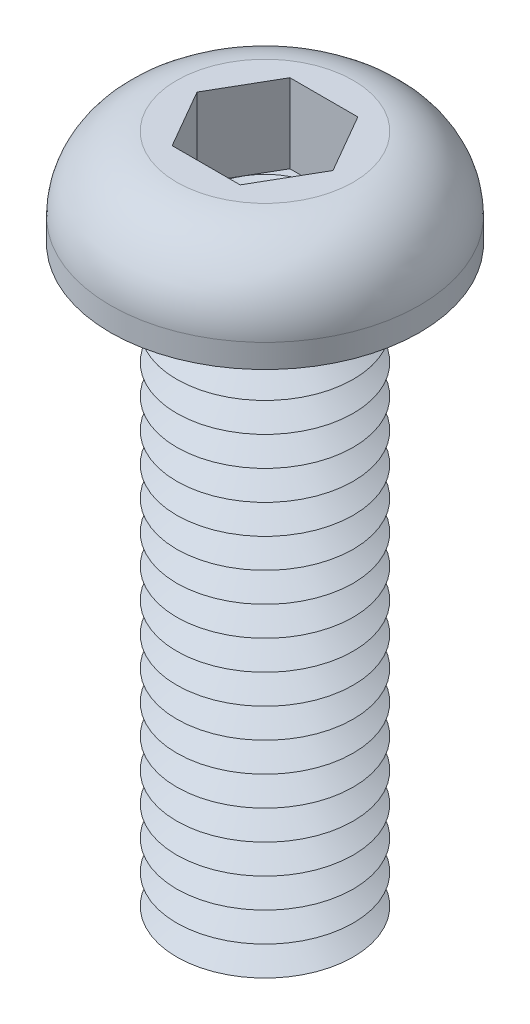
ISO-10303-21;
HEADER;
FILE_DESCRIPTION(('STEP AP214'),'2;1');
FILE_NAME('part.step','',(''),(''),'','','');
FILE_SCHEMA(('AUTOMOTIVE_DESIGN { 1 0 10303 214 1 1 1 1 }'));
ENDSEC;
DATA;
#1=APPLICATION_CONTEXT('core data for automotive mechanical design processes');
#2=APPLICATION_PROTOCOL_DEFINITION('international standard','automotive_design',2000,#1);
#3=PRODUCT_CONTEXT('',#1,'mechanical');
#4=PRODUCT('Part','Part','',(#3));
#5=PRODUCT_RELATED_PRODUCT_CATEGORY('part','',(#4));
#6=PRODUCT_DEFINITION_FORMATION('','',#4);
#7=PRODUCT_DEFINITION_CONTEXT('part definition',#1,'design');
#8=PRODUCT_DEFINITION('design','',#6,#7);
#9=PRODUCT_DEFINITION_SHAPE('','',#8);
#10=(LENGTH_UNIT() NAMED_UNIT(*) SI_UNIT(.MILLI.,.METRE.));
#11=(NAMED_UNIT(*) PLANE_ANGLE_UNIT() SI_UNIT($,.RADIAN.));
#12=(NAMED_UNIT(*) SI_UNIT($,.STERADIAN.) SOLID_ANGLE_UNIT());
#13=UNCERTAINTY_MEASURE_WITH_UNIT(LENGTH_MEASURE(1.E-05),#10,'distance_accuracy_value','');
#14=(GEOMETRIC_REPRESENTATION_CONTEXT(3) GLOBAL_UNCERTAINTY_ASSIGNED_CONTEXT((#13)) GLOBAL_UNIT_ASSIGNED_CONTEXT((#10,
#11,#12)) REPRESENTATION_CONTEXT('',''));
#15=CARTESIAN_POINT('',(0.,0.,0.));
#16=DIRECTION('',(0.,0.,1.));
#17=DIRECTION('',(1.,0.,0.));
#18=AXIS2_PLACEMENT_3D('',#15,#16,#17);
#19=CARTESIAN_POINT('',(0.,0.,0.));
#20=DIRECTION('',(0.,-1.,0.));
#21=DIRECTION('',(0.,0.,-1.));
#22=AXIS2_PLACEMENT_3D('',#19,#20,#21);
#23=TOROIDAL_SURFACE('',#22,3.5,0.5);
#24=CARTESIAN_POINT('',(0.,0.,-4.));
#25=VERTEX_POINT('',#24);
#26=VERTEX_LOOP('',#25);
#27=FACE_BOUND('',#26,.T.);
#28=ADVANCED_FACE('P0_F12',(#27),#23,.T.);
#29=CLOSED_SHELL('',(#28));
#30=MANIFOLD_SOLID_BREP('P0_B1',#29);
#31=CARTESIAN_POINT('',(1.15470053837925,0.62,-2.));
#32=DIRECTION('',(0.,1.,0.));
#33=DIRECTION('',(0.,0.,1.));
#34=AXIS2_PLACEMENT_3D('',#31,#32,#33);
#35=PLANE('',#34);
#36=CARTESIAN_POINT('',(0.,0.62,0.));
#37=DIRECTION('',(0.,1.,0.));
#38=DIRECTION('',(0.,0.,1.));
#39=AXIS2_PLACEMENT_3D('',#36,#37,#38);
#40=CIRCLE('',#39,2.);
#41=CARTESIAN_POINT('',(0.,0.62,2.));
#42=VERTEX_POINT('',#41);
#43=CARTESIAN_POINT('',(1.73205080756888,0.62,1.));
#44=VERTEX_POINT('',#43);
#45=EDGE_CURVE('P1_E93',#42,#44,#40,.T.);
#46=ORIENTED_EDGE('',*,*,#45,.F.);
#47=DIRECTION('',(1.,0.,0.));
#48=VECTOR('',#47,1.);
#49=CARTESIAN_POINT('',(-1.15470053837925,0.62,2.));
#50=LINE('',#49,#48);
#51=CARTESIAN_POINT('',(1.15470053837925,0.62,2.));
#52=VERTEX_POINT('',#51);
#53=EDGE_CURVE('P1_E116',#42,#52,#50,.T.);
#54=ORIENTED_EDGE('',*,*,#53,.T.);
#55=DIRECTION('',(0.5,0.,-0.866025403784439));
#56=VECTOR('',#55,1.);
#57=CARTESIAN_POINT('',(1.15470053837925,0.62,2.));
#58=LINE('',#57,#56);
#59=EDGE_CURVE('P1_E112',#52,#44,#58,.T.);
#60=ORIENTED_EDGE('',*,*,#59,.T.);
#61=EDGE_LOOP('',(#46,#54,#60));
#62=FACE_BOUND('',#61,.T.);
#63=ADVANCED_FACE('P1_F15',(#62),#35,.T.);
#64=CARTESIAN_POINT('',(0.,0.62,0.));
#65=DIRECTION('',(0.,1.,0.));
#66=DIRECTION('',(0.,0.,1.));
#67=AXIS2_PLACEMENT_3D('',#64,#65,#66);
#68=CIRCLE('',#67,2.);
#69=CARTESIAN_POINT('',(1.73205080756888,0.62,-1.));
#70=VERTEX_POINT('',#69);
#71=EDGE_CURVE('P1_E10',#44,#70,#68,.T.);
#72=ORIENTED_EDGE('',*,*,#71,.F.);
#73=CARTESIAN_POINT('',(2.3094010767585,0.62,0.));
#74=VERTEX_POINT('',#73);
#75=EDGE_CURVE('P1_E104',#44,#74,#58,.T.);
#76=ORIENTED_EDGE('',*,*,#75,.T.);
#77=DIRECTION('',(-0.5,0.,-0.866025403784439));
#78=VECTOR('',#77,1.);
#79=CARTESIAN_POINT('',(2.3094010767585,0.62,0.));
#80=LINE('',#79,#78);
#81=EDGE_CURVE('P1_E107',#74,#70,#80,.T.);
#82=ORIENTED_EDGE('',*,*,#81,.T.);
#83=EDGE_LOOP('',(#72,#76,#82));
#84=FACE_BOUND('',#83,.T.);
#85=ADVANCED_FACE('P1_F103',(#84),#35,.T.);
#86=CARTESIAN_POINT('',(0.,0.62,-2.));
#87=VERTEX_POINT('',#86);
#88=EDGE_CURVE('P1_E24',#70,#87,#68,.T.);
#89=ORIENTED_EDGE('',*,*,#88,.F.);
#90=CARTESIAN_POINT('',(1.15470053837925,0.62,-2.));
#91=VERTEX_POINT('',#90);
#92=EDGE_CURVE('P1_E139',#70,#91,#80,.T.);
#93=ORIENTED_EDGE('',*,*,#92,.T.);
#94=DIRECTION('',(-1.,0.,0.));
#95=VECTOR('',#94,1.);
#96=CARTESIAN_POINT('',(1.15470053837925,0.62,-2.));
#97=LINE('',#96,#95);
#98=EDGE_CURVE('P1_E336',#91,#87,#97,.T.);
#99=ORIENTED_EDGE('',*,*,#98,.T.);
#100=EDGE_LOOP('',(#89,#93,#99));
#101=FACE_BOUND('',#100,.T.);
#102=ADVANCED_FACE('P1_F301',(#101),#35,.T.);
#103=CARTESIAN_POINT('',(-1.73205080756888,0.62,-1.));
#104=VERTEX_POINT('',#103);
#105=EDGE_CURVE('P1_E331',#87,#104,#68,.T.);
#106=ORIENTED_EDGE('',*,*,#105,.F.);
#107=CARTESIAN_POINT('',(-1.15470053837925,0.62,-2.));
#108=VERTEX_POINT('',#107);
#109=EDGE_CURVE('P1_E340',#87,#108,#97,.T.);
#110=ORIENTED_EDGE('',*,*,#109,.T.);
#111=DIRECTION('',(-0.5,0.,0.866025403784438));
#112=VECTOR('',#111,1.);
#113=CARTESIAN_POINT('',(-1.15470053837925,0.62,-2.));
#114=LINE('',#113,#112);
#115=EDGE_CURVE('P1_E335',#108,#104,#114,.T.);
#116=ORIENTED_EDGE('',*,*,#115,.T.);
#117=EDGE_LOOP('',(#106,#110,#116));
#118=FACE_BOUND('',#117,.T.);
#119=ADVANCED_FACE('P1_F315',(#118),#35,.T.);
#120=CARTESIAN_POINT('',(-1.73205080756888,0.62,1.));
#121=VERTEX_POINT('',#120);
#122=EDGE_CURVE('P1_E31',#104,#121,#68,.T.);
#123=ORIENTED_EDGE('',*,*,#122,.F.);
#124=CARTESIAN_POINT('',(-2.3094010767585,0.62,0.));
#125=VERTEX_POINT('',#124);
#126=EDGE_CURVE('P1_E327',#104,#125,#114,.T.);
#127=ORIENTED_EDGE('',*,*,#126,.T.);
#128=DIRECTION('',(0.5,0.,0.866025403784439));
#129=VECTOR('',#128,1.);
#130=CARTESIAN_POINT('',(-2.3094010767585,0.62,0.));
#131=LINE('',#130,#129);
#132=EDGE_CURVE('P1_E330',#125,#121,#131,.T.);
#133=ORIENTED_EDGE('',*,*,#132,.T.);
#134=EDGE_LOOP('',(#123,#127,#133));
#135=FACE_BOUND('',#134,.T.);
#136=ADVANCED_FACE('P1_F306',(#135),#35,.T.);
#137=CARTESIAN_POINT('',(0.,-19.,0.));
#138=DIRECTION('',(0.,1.,0.));
#139=DIRECTION('',(0.,0.,1.));
#140=AXIS2_PLACEMENT_3D('',#137,#138,#139);
#141=CONICAL_SURFACE('',#140,2.13397459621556,1.0471975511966);
#142=CARTESIAN_POINT('',(0.,-18.5,0.));
#143=DIRECTION('',(0.,-1.,0.));
#144=DIRECTION('',(0.,0.,-1.));
#145=AXIS2_PLACEMENT_3D('',#142,#143,#144);
#146=CIRCLE('',#145,3.);
#147=CARTESIAN_POINT('',(0.,-18.5,-3.));
#148=VERTEX_POINT('',#147);
#149=EDGE_CURVE('P1_E263',#148,#148,#146,.T.);
#150=ORIENTED_EDGE('',*,*,#149,.T.);
#151=EDGE_LOOP('',(#150));
#152=FACE_BOUND('',#151,.T.);
#153=CARTESIAN_POINT('',(0.,-19.,0.));
#154=DIRECTION('',(0.,-1.,0.));
#155=DIRECTION('',(0.,0.,-1.));
#156=AXIS2_PLACEMENT_3D('',#153,#154,#155);
#157=CIRCLE('',#156,2.13397459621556);
#158=CARTESIAN_POINT('',(0.,-19.,-2.13397459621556));
#159=VERTEX_POINT('',#158);
#160=EDGE_CURVE('P1_E266',#159,#159,#157,.T.);
#161=ORIENTED_EDGE('',*,*,#160,.F.);
#162=EDGE_LOOP('',(#161));
#163=FACE_BOUND('',#162,.T.);
#164=ADVANCED_FACE('P1_F314',(#152,#163),#141,.T.);
#165=CARTESIAN_POINT('',(0.,-19.5,0.));
#166=DIRECTION('',(0.,-1.,0.));
#167=DIRECTION('',(0.,0.,-1.));
#168=AXIS2_PLACEMENT_3D('',#165,#166,#167);
#169=CONICAL_SURFACE('',#168,3.,1.0471975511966);
#170=ORIENTED_EDGE('',*,*,#160,.T.);
#171=EDGE_LOOP('',(#170));
#172=FACE_BOUND('',#171,.T.);
#173=CARTESIAN_POINT('',(0.,-19.5,0.));
#174=DIRECTION('',(0.,-1.,0.));
#175=DIRECTION('',(0.,0.,-1.));
#176=AXIS2_PLACEMENT_3D('',#173,#174,#175);
#177=CIRCLE('',#176,3.);
#178=CARTESIAN_POINT('',(0.,-19.5,-3.));
#179=VERTEX_POINT('',#178);
#180=EDGE_CURVE('P1_E269',#179,#179,#177,.T.);
#181=ORIENTED_EDGE('',*,*,#180,.F.);
#182=EDGE_LOOP('',(#181));
#183=FACE_BOUND('',#182,.T.);
#184=ADVANCED_FACE('P1_F321',(#172,#183),#169,.T.);
#185=CARTESIAN_POINT('',(0.,-20.,0.));
#186=DIRECTION('',(0.,1.,0.));
#187=DIRECTION('',(0.,0.,1.));
#188=AXIS2_PLACEMENT_3D('',#185,#186,#187);
#189=PLANE('',#188);
#190=CARTESIAN_POINT('',(0.,-20.,0.));
#191=DIRECTION('',(0.,-1.,0.));
#192=DIRECTION('',(0.,0.,-1.));
#193=AXIS2_PLACEMENT_3D('',#190,#191,#192);
#194=CIRCLE('',#193,2.13397459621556);
#195=CARTESIAN_POINT('',(0.,-20.,-2.13397459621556));
#196=VERTEX_POINT('',#195);
#197=EDGE_CURVE('P1_E272',#196,#196,#194,.T.);
#198=ORIENTED_EDGE('',*,*,#197,.T.);
#199=EDGE_LOOP('',(#198));
#200=FACE_BOUND('',#199,.T.);
#201=ADVANCED_FACE('P1_F399',(#200),#189,.F.);
#202=CARTESIAN_POINT('',(0.,-20.,0.));
#203=DIRECTION('',(0.,1.,0.));
#204=DIRECTION('',(0.,0.,1.));
#205=AXIS2_PLACEMENT_3D('',#202,#203,#204);
#206=CONICAL_SURFACE('',#205,2.13397459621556,1.0471975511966);
#207=ORIENTED_EDGE('',*,*,#180,.T.);
#208=EDGE_LOOP('',(#207));
#209=FACE_BOUND('',#208,.T.);
#210=ORIENTED_EDGE('',*,*,#197,.F.);
#211=EDGE_LOOP('',(#210));
#212=FACE_BOUND('',#211,.T.);
#213=ADVANCED_FACE('P1_F410',(#209,#212),#206,.T.);
#214=CARTESIAN_POINT('',(0.,-18.,0.));
#215=DIRECTION('',(0.,1.,0.));
#216=DIRECTION('',(0.,0.,1.));
#217=AXIS2_PLACEMENT_3D('',#214,#215,#216);
#218=CONICAL_SURFACE('',#217,2.13397459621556,1.0471975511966);
#219=CARTESIAN_POINT('',(0.,-17.5,0.));
#220=DIRECTION('',(0.,-1.,0.));
#221=DIRECTION('',(0.,0.,-1.));
#222=AXIS2_PLACEMENT_3D('',#219,#220,#221);
#223=CIRCLE('',#222,3.);
#224=CARTESIAN_POINT('',(0.,-17.5,-3.));
#225=VERTEX_POINT('',#224);
#226=EDGE_CURVE('P1_E257',#225,#225,#223,.T.);
#227=ORIENTED_EDGE('',*,*,#226,.T.);
#228=EDGE_LOOP('',(#227));
#229=FACE_BOUND('',#228,.T.);
#230=CARTESIAN_POINT('',(0.,-18.,0.));
#231=DIRECTION('',(0.,-1.,0.));
#232=DIRECTION('',(0.,0.,-1.));
#233=AXIS2_PLACEMENT_3D('',#230,#231,#232);
#234=CIRCLE('',#233,2.13397459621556);
#235=CARTESIAN_POINT('',(0.,-18.,-2.13397459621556));
#236=VERTEX_POINT('',#235);
#237=EDGE_CURVE('P1_E260',#236,#236,#234,.T.);
#238=ORIENTED_EDGE('',*,*,#237,.F.);
#239=EDGE_LOOP('',(#238));
#240=FACE_BOUND('',#239,.T.);
#241=ADVANCED_FACE('P1_F419',(#229,#240),#218,.T.);
#242=CARTESIAN_POINT('',(0.,-18.5,0.));
#243=DIRECTION('',(0.,-1.,0.));
#244=DIRECTION('',(0.,0.,-1.));
#245=AXIS2_PLACEMENT_3D('',#242,#243,#244);
#246=CONICAL_SURFACE('',#245,3.,1.0471975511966);
#247=ORIENTED_EDGE('',*,*,#237,.T.);
#248=EDGE_LOOP('',(#247));
#249=FACE_BOUND('',#248,.T.);
#250=ORIENTED_EDGE('',*,*,#149,.F.);
#251=EDGE_LOOP('',(#250));
#252=FACE_BOUND('',#251,.T.);
#253=ADVANCED_FACE('P1_F428',(#249,#252),#246,.T.);
#254=CARTESIAN_POINT('',(0.,-17.,0.));
#255=DIRECTION('',(0.,1.,0.));
#256=DIRECTION('',(0.,0.,1.));
#257=AXIS2_PLACEMENT_3D('',#254,#255,#256);
#258=CONICAL_SURFACE('',#257,2.13397459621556,1.0471975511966);
#259=CARTESIAN_POINT('',(0.,-16.5,0.));
#260=DIRECTION('',(0.,-1.,0.));
#261=DIRECTION('',(0.,0.,-1.));
#262=AXIS2_PLACEMENT_3D('',#259,#260,#261);
#263=CIRCLE('',#262,3.);
#264=CARTESIAN_POINT('',(0.,-16.5,-3.));
#265=VERTEX_POINT('',#264);
#266=EDGE_CURVE('P1_E251',#265,#265,#263,.T.);
#267=ORIENTED_EDGE('',*,*,#266,.T.);
#268=EDGE_LOOP('',(#267));
#269=FACE_BOUND('',#268,.T.);
#270=CARTESIAN_POINT('',(0.,-17.,0.));
#271=DIRECTION('',(0.,-1.,0.));
#272=DIRECTION('',(0.,0.,-1.));
#273=AXIS2_PLACEMENT_3D('',#270,#271,#272);
#274=CIRCLE('',#273,2.13397459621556);
#275=CARTESIAN_POINT('',(0.,-17.,-2.13397459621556));
#276=VERTEX_POINT('',#275);
#277=EDGE_CURVE('P1_E254',#276,#276,#274,.T.);
#278=ORIENTED_EDGE('',*,*,#277,.F.);
#279=EDGE_LOOP('',(#278));
#280=FACE_BOUND('',#279,.T.);
#281=ADVANCED_FACE('P1_F438',(#269,#280),#258,.T.);
#282=CARTESIAN_POINT('',(0.,-17.5,0.));
#283=DIRECTION('',(0.,-1.,0.));
#284=DIRECTION('',(0.,0.,-1.));
#285=AXIS2_PLACEMENT_3D('',#282,#283,#284);
#286=CONICAL_SURFACE('',#285,3.,1.0471975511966);
#287=ORIENTED_EDGE('',*,*,#277,.T.);
#288=EDGE_LOOP('',(#287));
#289=FACE_BOUND('',#288,.T.);
#290=ORIENTED_EDGE('',*,*,#226,.F.);
#291=EDGE_LOOP('',(#290));
#292=FACE_BOUND('',#291,.T.);
#293=ADVANCED_FACE('P1_F448',(#289,#292),#286,.T.);
#294=CARTESIAN_POINT('',(0.,-16.,0.));
#295=DIRECTION('',(0.,1.,0.));
#296=DIRECTION('',(0.,0.,1.));
#297=AXIS2_PLACEMENT_3D('',#294,#295,#296);
#298=CONICAL_SURFACE('',#297,2.13397459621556,1.0471975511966);
#299=CARTESIAN_POINT('',(0.,-15.5,0.));
#300=DIRECTION('',(0.,-1.,0.));
#301=DIRECTION('',(0.,0.,-1.));
#302=AXIS2_PLACEMENT_3D('',#299,#300,#301);
#303=CIRCLE('',#302,3.);
#304=CARTESIAN_POINT('',(0.,-15.5,-3.));
#305=VERTEX_POINT('',#304);
#306=EDGE_CURVE('P1_E245',#305,#305,#303,.T.);
#307=ORIENTED_EDGE('',*,*,#306,.T.);
#308=EDGE_LOOP('',(#307));
#309=FACE_BOUND('',#308,.T.);
#310=CARTESIAN_POINT('',(0.,-16.,0.));
#311=DIRECTION('',(0.,-1.,0.));
#312=DIRECTION('',(0.,0.,-1.));
#313=AXIS2_PLACEMENT_3D('',#310,#311,#312);
#314=CIRCLE('',#313,2.13397459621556);
#315=CARTESIAN_POINT('',(0.,-16.,-2.13397459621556));
#316=VERTEX_POINT('',#315);
#317=EDGE_CURVE('P1_E248',#316,#316,#314,.T.);
#318=ORIENTED_EDGE('',*,*,#317,.F.);
#319=EDGE_LOOP('',(#318));
#320=FACE_BOUND('',#319,.T.);
#321=ADVANCED_FACE('P1_F458',(#309,#320),#298,.T.);
#322=CARTESIAN_POINT('',(0.,-16.5,0.));
#323=DIRECTION('',(0.,-1.,0.));
#324=DIRECTION('',(0.,0.,-1.));
#325=AXIS2_PLACEMENT_3D('',#322,#323,#324);
#326=CONICAL_SURFACE('',#325,3.,1.0471975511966);
#327=ORIENTED_EDGE('',*,*,#317,.T.);
#328=EDGE_LOOP('',(#327));
#329=FACE_BOUND('',#328,.T.);
#330=ORIENTED_EDGE('',*,*,#266,.F.);
#331=EDGE_LOOP('',(#330));
#332=FACE_BOUND('',#331,.T.);
#333=ADVANCED_FACE('P1_F468',(#329,#332),#326,.T.);
#334=CARTESIAN_POINT('',(0.,-15.,0.));
#335=DIRECTION('',(0.,1.,0.));
#336=DIRECTION('',(0.,0.,1.));
#337=AXIS2_PLACEMENT_3D('',#334,#335,#336);
#338=CONICAL_SURFACE('',#337,2.13397459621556,1.0471975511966);
#339=CARTESIAN_POINT('',(0.,-14.5,0.));
#340=DIRECTION('',(0.,-1.,0.));
#341=DIRECTION('',(0.,0.,-1.));
#342=AXIS2_PLACEMENT_3D('',#339,#340,#341);
#343=CIRCLE('',#342,3.);
#344=CARTESIAN_POINT('',(0.,-14.5,-3.));
#345=VERTEX_POINT('',#344);
#346=EDGE_CURVE('P1_E239',#345,#345,#343,.T.);
#347=ORIENTED_EDGE('',*,*,#346,.T.);
#348=EDGE_LOOP('',(#347));
#349=FACE_BOUND('',#348,.T.);
#350=CARTESIAN_POINT('',(0.,-15.,0.));
#351=DIRECTION('',(0.,-1.,0.));
#352=DIRECTION('',(0.,0.,-1.));
#353=AXIS2_PLACEMENT_3D('',#350,#351,#352);
#354=CIRCLE('',#353,2.13397459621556);
#355=CARTESIAN_POINT('',(0.,-15.,-2.13397459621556));
#356=VERTEX_POINT('',#355);
#357=EDGE_CURVE('P1_E242',#356,#356,#354,.T.);
#358=ORIENTED_EDGE('',*,*,#357,.F.);
#359=EDGE_LOOP('',(#358));
#360=FACE_BOUND('',#359,.T.);
#361=ADVANCED_FACE('P1_F478',(#349,#360),#338,.T.);
#362=CARTESIAN_POINT('',(0.,-15.5,0.));
#363=DIRECTION('',(0.,-1.,0.));
#364=DIRECTION('',(0.,0.,-1.));
#365=AXIS2_PLACEMENT_3D('',#362,#363,#364);
#366=CONICAL_SURFACE('',#365,3.,1.0471975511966);
#367=ORIENTED_EDGE('',*,*,#357,.T.);
#368=EDGE_LOOP('',(#367));
#369=FACE_BOUND('',#368,.T.);
#370=ORIENTED_EDGE('',*,*,#306,.F.);
#371=EDGE_LOOP('',(#370));
#372=FACE_BOUND('',#371,.T.);
#373=ADVANCED_FACE('P1_F488',(#369,#372),#366,.T.);
#374=CARTESIAN_POINT('',(0.,-14.,0.));
#375=DIRECTION('',(0.,1.,0.));
#376=DIRECTION('',(0.,0.,1.));
#377=AXIS2_PLACEMENT_3D('',#374,#375,#376);
#378=CONICAL_SURFACE('',#377,2.13397459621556,1.0471975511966);
#379=CARTESIAN_POINT('',(0.,-13.5,0.));
#380=DIRECTION('',(0.,-1.,0.));
#381=DIRECTION('',(0.,0.,-1.));
#382=AXIS2_PLACEMENT_3D('',#379,#380,#381);
#383=CIRCLE('',#382,3.);
#384=CARTESIAN_POINT('',(0.,-13.5,-3.));
#385=VERTEX_POINT('',#384);
#386=EDGE_CURVE('P1_E233',#385,#385,#383,.T.);
#387=ORIENTED_EDGE('',*,*,#386,.T.);
#388=EDGE_LOOP('',(#387));
#389=FACE_BOUND('',#388,.T.);
#390=CARTESIAN_POINT('',(0.,-14.,0.));
#391=DIRECTION('',(0.,-1.,0.));
#392=DIRECTION('',(0.,0.,-1.));
#393=AXIS2_PLACEMENT_3D('',#390,#391,#392);
#394=CIRCLE('',#393,2.13397459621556);
#395=CARTESIAN_POINT('',(0.,-14.,-2.13397459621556));
#396=VERTEX_POINT('',#395);
#397=EDGE_CURVE('P1_E236',#396,#396,#394,.T.);
#398=ORIENTED_EDGE('',*,*,#397,.F.);
#399=EDGE_LOOP('',(#398));
#400=FACE_BOUND('',#399,.T.);
#401=ADVANCED_FACE('P1_F498',(#389,#400),#378,.T.);
#402=CARTESIAN_POINT('',(0.,-14.5,0.));
#403=DIRECTION('',(0.,-1.,0.));
#404=DIRECTION('',(0.,0.,-1.));
#405=AXIS2_PLACEMENT_3D('',#402,#403,#404);
#406=CONICAL_SURFACE('',#405,3.,1.0471975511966);
#407=ORIENTED_EDGE('',*,*,#397,.T.);
#408=EDGE_LOOP('',(#407));
#409=FACE_BOUND('',#408,.T.);
#410=ORIENTED_EDGE('',*,*,#346,.F.);
#411=EDGE_LOOP('',(#410));
#412=FACE_BOUND('',#411,.T.);
#413=ADVANCED_FACE('P1_F508',(#409,#412),#406,.T.);
#414=CARTESIAN_POINT('',(0.,-13.,0.));
#415=DIRECTION('',(0.,1.,0.));
#416=DIRECTION('',(0.,0.,1.));
#417=AXIS2_PLACEMENT_3D('',#414,#415,#416);
#418=CONICAL_SURFACE('',#417,2.13397459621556,1.0471975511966);
#419=CARTESIAN_POINT('',(0.,-12.5,0.));
#420=DIRECTION('',(0.,-1.,0.));
#421=DIRECTION('',(0.,0.,-1.));
#422=AXIS2_PLACEMENT_3D('',#419,#420,#421);
#423=CIRCLE('',#422,3.);
#424=CARTESIAN_POINT('',(0.,-12.5,-3.));
#425=VERTEX_POINT('',#424);
#426=EDGE_CURVE('P1_E227',#425,#425,#423,.T.);
#427=ORIENTED_EDGE('',*,*,#426,.T.);
#428=EDGE_LOOP('',(#427));
#429=FACE_BOUND('',#428,.T.);
#430=CARTESIAN_POINT('',(0.,-13.,0.));
#431=DIRECTION('',(0.,-1.,0.));
#432=DIRECTION('',(0.,0.,-1.));
#433=AXIS2_PLACEMENT_3D('',#430,#431,#432);
#434=CIRCLE('',#433,2.13397459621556);
#435=CARTESIAN_POINT('',(0.,-13.,-2.13397459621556));
#436=VERTEX_POINT('',#435);
#437=EDGE_CURVE('P1_E230',#436,#436,#434,.T.);
#438=ORIENTED_EDGE('',*,*,#437,.F.);
#439=EDGE_LOOP('',(#438));
#440=FACE_BOUND('',#439,.T.);
#441=ADVANCED_FACE('P1_F518',(#429,#440),#418,.T.);
#442=CARTESIAN_POINT('',(0.,-13.5,0.));
#443=DIRECTION('',(0.,-1.,0.));
#444=DIRECTION('',(0.,0.,-1.));
#445=AXIS2_PLACEMENT_3D('',#442,#443,#444);
#446=CONICAL_SURFACE('',#445,3.,1.0471975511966);
#447=ORIENTED_EDGE('',*,*,#437,.T.);
#448=EDGE_LOOP('',(#447));
#449=FACE_BOUND('',#448,.T.);
#450=ORIENTED_EDGE('',*,*,#386,.F.);
#451=EDGE_LOOP('',(#450));
#452=FACE_BOUND('',#451,.T.);
#453=ADVANCED_FACE('P1_F528',(#449,#452),#446,.T.);
#454=CARTESIAN_POINT('',(0.,-12.,0.));
#455=DIRECTION('',(0.,1.,0.));
#456=DIRECTION('',(0.,0.,1.));
#457=AXIS2_PLACEMENT_3D('',#454,#455,#456);
#458=CONICAL_SURFACE('',#457,2.13397459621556,1.0471975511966);
#459=CARTESIAN_POINT('',(0.,-11.5,0.));
#460=DIRECTION('',(0.,-1.,0.));
#461=DIRECTION('',(0.,0.,-1.));
#462=AXIS2_PLACEMENT_3D('',#459,#460,#461);
#463=CIRCLE('',#462,3.);
#464=CARTESIAN_POINT('',(0.,-11.5,-3.));
#465=VERTEX_POINT('',#464);
#466=EDGE_CURVE('P1_E221',#465,#465,#463,.T.);
#467=ORIENTED_EDGE('',*,*,#466,.T.);
#468=EDGE_LOOP('',(#467));
#469=FACE_BOUND('',#468,.T.);
#470=CARTESIAN_POINT('',(0.,-12.,0.));
#471=DIRECTION('',(0.,-1.,0.));
#472=DIRECTION('',(0.,0.,-1.));
#473=AXIS2_PLACEMENT_3D('',#470,#471,#472);
#474=CIRCLE('',#473,2.13397459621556);
#475=CARTESIAN_POINT('',(0.,-12.,-2.13397459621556));
#476=VERTEX_POINT('',#475);
#477=EDGE_CURVE('P1_E224',#476,#476,#474,.T.);
#478=ORIENTED_EDGE('',*,*,#477,.F.);
#479=EDGE_LOOP('',(#478));
#480=FACE_BOUND('',#479,.T.);
#481=ADVANCED_FACE('P1_F538',(#469,#480),#458,.T.);
#482=CARTESIAN_POINT('',(0.,-12.5,0.));
#483=DIRECTION('',(0.,-1.,0.));
#484=DIRECTION('',(0.,0.,-1.));
#485=AXIS2_PLACEMENT_3D('',#482,#483,#484);
#486=CONICAL_SURFACE('',#485,3.,1.0471975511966);
#487=ORIENTED_EDGE('',*,*,#477,.T.);
#488=EDGE_LOOP('',(#487));
#489=FACE_BOUND('',#488,.T.);
#490=ORIENTED_EDGE('',*,*,#426,.F.);
#491=EDGE_LOOP('',(#490));
#492=FACE_BOUND('',#491,.T.);
#493=ADVANCED_FACE('P1_F548',(#489,#492),#486,.T.);
#494=CARTESIAN_POINT('',(0.,-11.,0.));
#495=DIRECTION('',(0.,1.,0.));
#496=DIRECTION('',(0.,0.,1.));
#497=AXIS2_PLACEMENT_3D('',#494,#495,#496);
#498=CONICAL_SURFACE('',#497,2.13397459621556,1.0471975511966);
#499=CARTESIAN_POINT('',(0.,-10.5,0.));
#500=DIRECTION('',(0.,-1.,0.));
#501=DIRECTION('',(0.,0.,-1.));
#502=AXIS2_PLACEMENT_3D('',#499,#500,#501);
#503=CIRCLE('',#502,3.);
#504=CARTESIAN_POINT('',(0.,-10.5,-3.));
#505=VERTEX_POINT('',#504);
#506=EDGE_CURVE('P1_E215',#505,#505,#503,.T.);
#507=ORIENTED_EDGE('',*,*,#506,.T.);
#508=EDGE_LOOP('',(#507));
#509=FACE_BOUND('',#508,.T.);
#510=CARTESIAN_POINT('',(0.,-11.,0.));
#511=DIRECTION('',(0.,-1.,0.));
#512=DIRECTION('',(0.,0.,-1.));
#513=AXIS2_PLACEMENT_3D('',#510,#511,#512);
#514=CIRCLE('',#513,2.13397459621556);
#515=CARTESIAN_POINT('',(0.,-11.,-2.13397459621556));
#516=VERTEX_POINT('',#515);
#517=EDGE_CURVE('P1_E218',#516,#516,#514,.T.);
#518=ORIENTED_EDGE('',*,*,#517,.F.);
#519=EDGE_LOOP('',(#518));
#520=FACE_BOUND('',#519,.T.);
#521=ADVANCED_FACE('P1_F558',(#509,#520),#498,.T.);
#522=CARTESIAN_POINT('',(0.,-11.5,0.));
#523=DIRECTION('',(0.,-1.,0.));
#524=DIRECTION('',(0.,0.,-1.));
#525=AXIS2_PLACEMENT_3D('',#522,#523,#524);
#526=CONICAL_SURFACE('',#525,3.,1.0471975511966);
#527=ORIENTED_EDGE('',*,*,#517,.T.);
#528=EDGE_LOOP('',(#527));
#529=FACE_BOUND('',#528,.T.);
#530=ORIENTED_EDGE('',*,*,#466,.F.);
#531=EDGE_LOOP('',(#530));
#532=FACE_BOUND('',#531,.T.);
#533=ADVANCED_FACE('P1_F568',(#529,#532),#526,.T.);
#534=CARTESIAN_POINT('',(0.,-10.,0.));
#535=DIRECTION('',(0.,1.,0.));
#536=DIRECTION('',(0.,0.,1.));
#537=AXIS2_PLACEMENT_3D('',#534,#535,#536);
#538=CONICAL_SURFACE('',#537,2.13397459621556,1.0471975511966);
#539=CARTESIAN_POINT('',(0.,-9.5,0.));
#540=DIRECTION('',(0.,-1.,0.));
#541=DIRECTION('',(0.,0.,-1.));
#542=AXIS2_PLACEMENT_3D('',#539,#540,#541);
#543=CIRCLE('',#542,3.);
#544=CARTESIAN_POINT('',(0.,-9.5,-3.));
#545=VERTEX_POINT('',#544);
#546=EDGE_CURVE('P1_E209',#545,#545,#543,.T.);
#547=ORIENTED_EDGE('',*,*,#546,.T.);
#548=EDGE_LOOP('',(#547));
#549=FACE_BOUND('',#548,.T.);
#550=CARTESIAN_POINT('',(0.,-10.,0.));
#551=DIRECTION('',(0.,-1.,0.));
#552=DIRECTION('',(0.,0.,-1.));
#553=AXIS2_PLACEMENT_3D('',#550,#551,#552);
#554=CIRCLE('',#553,2.13397459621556);
#555=CARTESIAN_POINT('',(0.,-10.,-2.13397459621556));
#556=VERTEX_POINT('',#555);
#557=EDGE_CURVE('P1_E212',#556,#556,#554,.T.);
#558=ORIENTED_EDGE('',*,*,#557,.F.);
#559=EDGE_LOOP('',(#558));
#560=FACE_BOUND('',#559,.T.);
#561=ADVANCED_FACE('P1_F578',(#549,#560),#538,.T.);
#562=CARTESIAN_POINT('',(0.,-10.5,0.));
#563=DIRECTION('',(0.,-1.,0.));
#564=DIRECTION('',(0.,0.,-1.));
#565=AXIS2_PLACEMENT_3D('',#562,#563,#564);
#566=CONICAL_SURFACE('',#565,3.,1.0471975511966);
#567=ORIENTED_EDGE('',*,*,#557,.T.);
#568=EDGE_LOOP('',(#567));
#569=FACE_BOUND('',#568,.T.);
#570=ORIENTED_EDGE('',*,*,#506,.F.);
#571=EDGE_LOOP('',(#570));
#572=FACE_BOUND('',#571,.T.);
#573=ADVANCED_FACE('P1_F588',(#569,#572),#566,.T.);
#574=CARTESIAN_POINT('',(0.,-9.,0.));
#575=DIRECTION('',(0.,1.,0.));
#576=DIRECTION('',(0.,0.,1.));
#577=AXIS2_PLACEMENT_3D('',#574,#575,#576);
#578=CONICAL_SURFACE('',#577,2.13397459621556,1.0471975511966);
#579=CARTESIAN_POINT('',(0.,-8.5,0.));
#580=DIRECTION('',(0.,-1.,0.));
#581=DIRECTION('',(0.,0.,-1.));
#582=AXIS2_PLACEMENT_3D('',#579,#580,#581);
#583=CIRCLE('',#582,3.);
#584=CARTESIAN_POINT('',(0.,-8.5,-3.));
#585=VERTEX_POINT('',#584);
#586=EDGE_CURVE('P1_E203',#585,#585,#583,.T.);
#587=ORIENTED_EDGE('',*,*,#586,.T.);
#588=EDGE_LOOP('',(#587));
#589=FACE_BOUND('',#588,.T.);
#590=CARTESIAN_POINT('',(0.,-9.,0.));
#591=DIRECTION('',(0.,-1.,0.));
#592=DIRECTION('',(0.,0.,-1.));
#593=AXIS2_PLACEMENT_3D('',#590,#591,#592);
#594=CIRCLE('',#593,2.13397459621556);
#595=CARTESIAN_POINT('',(0.,-9.,-2.13397459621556));
#596=VERTEX_POINT('',#595);
#597=EDGE_CURVE('P1_E206',#596,#596,#594,.T.);
#598=ORIENTED_EDGE('',*,*,#597,.F.);
#599=EDGE_LOOP('',(#598));
#600=FACE_BOUND('',#599,.T.);
#601=ADVANCED_FACE('P1_F598',(#589,#600),#578,.T.);
#602=CARTESIAN_POINT('',(0.,-9.5,0.));
#603=DIRECTION('',(0.,-1.,0.));
#604=DIRECTION('',(0.,0.,-1.));
#605=AXIS2_PLACEMENT_3D('',#602,#603,#604);
#606=CONICAL_SURFACE('',#605,3.,1.0471975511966);
#607=ORIENTED_EDGE('',*,*,#597,.T.);
#608=EDGE_LOOP('',(#607));
#609=FACE_BOUND('',#608,.T.);
#610=ORIENTED_EDGE('',*,*,#546,.F.);
#611=EDGE_LOOP('',(#610));
#612=FACE_BOUND('',#611,.T.);
#613=ADVANCED_FACE('P1_F608',(#609,#612),#606,.T.);
#614=CARTESIAN_POINT('',(0.,-8.,0.));
#615=DIRECTION('',(0.,1.,0.));
#616=DIRECTION('',(0.,0.,1.));
#617=AXIS2_PLACEMENT_3D('',#614,#615,#616);
#618=CONICAL_SURFACE('',#617,2.13397459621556,1.0471975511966);
#619=CARTESIAN_POINT('',(0.,-7.5,0.));
#620=DIRECTION('',(0.,-1.,0.));
#621=DIRECTION('',(0.,0.,-1.));
#622=AXIS2_PLACEMENT_3D('',#619,#620,#621);
#623=CIRCLE('',#622,3.);
#624=CARTESIAN_POINT('',(0.,-7.5,-3.));
#625=VERTEX_POINT('',#624);
#626=EDGE_CURVE('P1_E197',#625,#625,#623,.T.);
#627=ORIENTED_EDGE('',*,*,#626,.T.);
#628=EDGE_LOOP('',(#627));
#629=FACE_BOUND('',#628,.T.);
#630=CARTESIAN_POINT('',(0.,-8.,0.));
#631=DIRECTION('',(0.,-1.,0.));
#632=DIRECTION('',(0.,0.,-1.));
#633=AXIS2_PLACEMENT_3D('',#630,#631,#632);
#634=CIRCLE('',#633,2.13397459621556);
#635=CARTESIAN_POINT('',(0.,-8.,-2.13397459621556));
#636=VERTEX_POINT('',#635);
#637=EDGE_CURVE('P1_E200',#636,#636,#634,.T.);
#638=ORIENTED_EDGE('',*,*,#637,.F.);
#639=EDGE_LOOP('',(#638));
#640=FACE_BOUND('',#639,.T.);
#641=ADVANCED_FACE('P1_F618',(#629,#640),#618,.T.);
#642=CARTESIAN_POINT('',(0.,-8.5,0.));
#643=DIRECTION('',(0.,-1.,0.));
#644=DIRECTION('',(0.,0.,-1.));
#645=AXIS2_PLACEMENT_3D('',#642,#643,#644);
#646=CONICAL_SURFACE('',#645,3.,1.0471975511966);
#647=ORIENTED_EDGE('',*,*,#637,.T.);
#648=EDGE_LOOP('',(#647));
#649=FACE_BOUND('',#648,.T.);
#650=ORIENTED_EDGE('',*,*,#586,.F.);
#651=EDGE_LOOP('',(#650));
#652=FACE_BOUND('',#651,.T.);
#653=ADVANCED_FACE('P1_F628',(#649,#652),#646,.T.);
#654=CARTESIAN_POINT('',(0.,-7.,0.));
#655=DIRECTION('',(0.,1.,0.));
#656=DIRECTION('',(0.,0.,1.));
#657=AXIS2_PLACEMENT_3D('',#654,#655,#656);
#658=CONICAL_SURFACE('',#657,2.13397459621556,1.0471975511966);
#659=CARTESIAN_POINT('',(0.,-6.5,0.));
#660=DIRECTION('',(0.,-1.,0.));
#661=DIRECTION('',(0.,0.,-1.));
#662=AXIS2_PLACEMENT_3D('',#659,#660,#661);
#663=CIRCLE('',#662,3.);
#664=CARTESIAN_POINT('',(0.,-6.5,-3.));
#665=VERTEX_POINT('',#664);
#666=EDGE_CURVE('P1_E191',#665,#665,#663,.T.);
#667=ORIENTED_EDGE('',*,*,#666,.T.);
#668=EDGE_LOOP('',(#667));
#669=FACE_BOUND('',#668,.T.);
#670=CARTESIAN_POINT('',(0.,-7.,0.));
#671=DIRECTION('',(0.,-1.,0.));
#672=DIRECTION('',(0.,0.,-1.));
#673=AXIS2_PLACEMENT_3D('',#670,#671,#672);
#674=CIRCLE('',#673,2.13397459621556);
#675=CARTESIAN_POINT('',(0.,-7.,-2.13397459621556));
#676=VERTEX_POINT('',#675);
#677=EDGE_CURVE('P1_E194',#676,#676,#674,.T.);
#678=ORIENTED_EDGE('',*,*,#677,.F.);
#679=EDGE_LOOP('',(#678));
#680=FACE_BOUND('',#679,.T.);
#681=ADVANCED_FACE('P1_F638',(#669,#680),#658,.T.);
#682=CARTESIAN_POINT('',(0.,-7.5,0.));
#683=DIRECTION('',(0.,-1.,0.));
#684=DIRECTION('',(0.,0.,-1.));
#685=AXIS2_PLACEMENT_3D('',#682,#683,#684);
#686=CONICAL_SURFACE('',#685,3.,1.0471975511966);
#687=ORIENTED_EDGE('',*,*,#677,.T.);
#688=EDGE_LOOP('',(#687));
#689=FACE_BOUND('',#688,.T.);
#690=ORIENTED_EDGE('',*,*,#626,.F.);
#691=EDGE_LOOP('',(#690));
#692=FACE_BOUND('',#691,.T.);
#693=ADVANCED_FACE('P1_F648',(#689,#692),#686,.T.);
#694=CARTESIAN_POINT('',(0.,-6.,0.));
#695=DIRECTION('',(0.,1.,0.));
#696=DIRECTION('',(0.,0.,1.));
#697=AXIS2_PLACEMENT_3D('',#694,#695,#696);
#698=CONICAL_SURFACE('',#697,2.13397459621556,1.0471975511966);
#699=CARTESIAN_POINT('',(0.,-5.5,0.));
#700=DIRECTION('',(0.,-1.,0.));
#701=DIRECTION('',(0.,0.,-1.));
#702=AXIS2_PLACEMENT_3D('',#699,#700,#701);
#703=CIRCLE('',#702,3.);
#704=CARTESIAN_POINT('',(0.,-5.5,-3.));
#705=VERTEX_POINT('',#704);
#706=EDGE_CURVE('P1_E185',#705,#705,#703,.T.);
#707=ORIENTED_EDGE('',*,*,#706,.T.);
#708=EDGE_LOOP('',(#707));
#709=FACE_BOUND('',#708,.T.);
#710=CARTESIAN_POINT('',(0.,-6.,0.));
#711=DIRECTION('',(0.,-1.,0.));
#712=DIRECTION('',(0.,0.,-1.));
#713=AXIS2_PLACEMENT_3D('',#710,#711,#712);
#714=CIRCLE('',#713,2.13397459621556);
#715=CARTESIAN_POINT('',(0.,-6.,-2.13397459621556));
#716=VERTEX_POINT('',#715);
#717=EDGE_CURVE('P1_E188',#716,#716,#714,.T.);
#718=ORIENTED_EDGE('',*,*,#717,.F.);
#719=EDGE_LOOP('',(#718));
#720=FACE_BOUND('',#719,.T.);
#721=ADVANCED_FACE('P1_F658',(#709,#720),#698,.T.);
#722=CARTESIAN_POINT('',(0.,-6.5,0.));
#723=DIRECTION('',(0.,-1.,0.));
#724=DIRECTION('',(0.,0.,-1.));
#725=AXIS2_PLACEMENT_3D('',#722,#723,#724);
#726=CONICAL_SURFACE('',#725,3.,1.0471975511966);
#727=ORIENTED_EDGE('',*,*,#717,.T.);
#728=EDGE_LOOP('',(#727));
#729=FACE_BOUND('',#728,.T.);
#730=ORIENTED_EDGE('',*,*,#666,.F.);
#731=EDGE_LOOP('',(#730));
#732=FACE_BOUND('',#731,.T.);
#733=ADVANCED_FACE('P1_F668',(#729,#732),#726,.T.);
#734=CARTESIAN_POINT('',(0.,-5.,0.));
#735=DIRECTION('',(0.,1.,0.));
#736=DIRECTION('',(0.,0.,1.));
#737=AXIS2_PLACEMENT_3D('',#734,#735,#736);
#738=CONICAL_SURFACE('',#737,2.13397459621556,1.0471975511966);
#739=CARTESIAN_POINT('',(0.,-4.5,0.));
#740=DIRECTION('',(0.,-1.,0.));
#741=DIRECTION('',(0.,0.,-1.));
#742=AXIS2_PLACEMENT_3D('',#739,#740,#741);
#743=CIRCLE('',#742,3.);
#744=CARTESIAN_POINT('',(0.,-4.5,-3.));
#745=VERTEX_POINT('',#744);
#746=EDGE_CURVE('P1_E179',#745,#745,#743,.T.);
#747=ORIENTED_EDGE('',*,*,#746,.T.);
#748=EDGE_LOOP('',(#747));
#749=FACE_BOUND('',#748,.T.);
#750=CARTESIAN_POINT('',(0.,-5.,0.));
#751=DIRECTION('',(0.,-1.,0.));
#752=DIRECTION('',(0.,0.,-1.));
#753=AXIS2_PLACEMENT_3D('',#750,#751,#752);
#754=CIRCLE('',#753,2.13397459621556);
#755=CARTESIAN_POINT('',(0.,-5.,-2.13397459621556));
#756=VERTEX_POINT('',#755);
#757=EDGE_CURVE('P1_E182',#756,#756,#754,.T.);
#758=ORIENTED_EDGE('',*,*,#757,.F.);
#759=EDGE_LOOP('',(#758));
#760=FACE_BOUND('',#759,.T.);
#761=ADVANCED_FACE('P1_F678',(#749,#760),#738,.T.);
#762=CARTESIAN_POINT('',(0.,-5.5,0.));
#763=DIRECTION('',(0.,-1.,0.));
#764=DIRECTION('',(0.,0.,-1.));
#765=AXIS2_PLACEMENT_3D('',#762,#763,#764);
#766=CONICAL_SURFACE('',#765,3.,1.0471975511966);
#767=ORIENTED_EDGE('',*,*,#757,.T.);
#768=EDGE_LOOP('',(#767));
#769=FACE_BOUND('',#768,.T.);
#770=ORIENTED_EDGE('',*,*,#706,.F.);
#771=EDGE_LOOP('',(#770));
#772=FACE_BOUND('',#771,.T.);
#773=ADVANCED_FACE('P1_F688',(#769,#772),#766,.T.);
#774=CARTESIAN_POINT('',(0.,-4.,0.));
#775=DIRECTION('',(0.,1.,0.));
#776=DIRECTION('',(0.,0.,1.));
#777=AXIS2_PLACEMENT_3D('',#774,#775,#776);
#778=CONICAL_SURFACE('',#777,2.13397459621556,1.0471975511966);
#779=CARTESIAN_POINT('',(0.,-3.5,0.));
#780=DIRECTION('',(0.,-1.,0.));
#781=DIRECTION('',(0.,0.,-1.));
#782=AXIS2_PLACEMENT_3D('',#779,#780,#781);
#783=CIRCLE('',#782,3.);
#784=CARTESIAN_POINT('',(0.,-3.5,-3.));
#785=VERTEX_POINT('',#784);
#786=EDGE_CURVE('P1_E173',#785,#785,#783,.T.);
#787=ORIENTED_EDGE('',*,*,#786,.T.);
#788=EDGE_LOOP('',(#787));
#789=FACE_BOUND('',#788,.T.);
#790=CARTESIAN_POINT('',(0.,-4.,0.));
#791=DIRECTION('',(0.,-1.,0.));
#792=DIRECTION('',(0.,0.,-1.));
#793=AXIS2_PLACEMENT_3D('',#790,#791,#792);
#794=CIRCLE('',#793,2.13397459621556);
#795=CARTESIAN_POINT('',(0.,-4.,-2.13397459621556));
#796=VERTEX_POINT('',#795);
#797=EDGE_CURVE('P1_E176',#796,#796,#794,.T.);
#798=ORIENTED_EDGE('',*,*,#797,.F.);
#799=EDGE_LOOP('',(#798));
#800=FACE_BOUND('',#799,.T.);
#801=ADVANCED_FACE('P1_F698',(#789,#800),#778,.T.);
#802=CARTESIAN_POINT('',(0.,-4.5,0.));
#803=DIRECTION('',(0.,-1.,0.));
#804=DIRECTION('',(0.,0.,-1.));
#805=AXIS2_PLACEMENT_3D('',#802,#803,#804);
#806=CONICAL_SURFACE('',#805,3.,1.0471975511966);
#807=ORIENTED_EDGE('',*,*,#797,.T.);
#808=EDGE_LOOP('',(#807));
#809=FACE_BOUND('',#808,.T.);
#810=ORIENTED_EDGE('',*,*,#746,.F.);
#811=EDGE_LOOP('',(#810));
#812=FACE_BOUND('',#811,.T.);
#813=ADVANCED_FACE('P1_F708',(#809,#812),#806,.T.);
#814=CARTESIAN_POINT('',(0.,-3.,0.));
#815=DIRECTION('',(0.,1.,0.));
#816=DIRECTION('',(0.,0.,1.));
#817=AXIS2_PLACEMENT_3D('',#814,#815,#816);
#818=CONICAL_SURFACE('',#817,2.13397459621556,1.0471975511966);
#819=CARTESIAN_POINT('',(0.,-2.5,0.));
#820=DIRECTION('',(0.,-1.,0.));
#821=DIRECTION('',(0.,0.,-1.));
#822=AXIS2_PLACEMENT_3D('',#819,#820,#821);
#823=CIRCLE('',#822,3.);
#824=CARTESIAN_POINT('',(0.,-2.5,-3.));
#825=VERTEX_POINT('',#824);
#826=EDGE_CURVE('P1_E164',#825,#825,#823,.T.);
#827=ORIENTED_EDGE('',*,*,#826,.T.);
#828=EDGE_LOOP('',(#827));
#829=FACE_BOUND('',#828,.T.);
#830=CARTESIAN_POINT('',(0.,-3.,0.));
#831=DIRECTION('',(0.,-1.,0.));
#832=DIRECTION('',(0.,0.,-1.));
#833=AXIS2_PLACEMENT_3D('',#830,#831,#832);
#834=CIRCLE('',#833,2.13397459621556);
#835=CARTESIAN_POINT('',(0.,-3.,-2.13397459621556));
#836=VERTEX_POINT('',#835);
#837=EDGE_CURVE('P1_E170',#836,#836,#834,.T.);
#838=ORIENTED_EDGE('',*,*,#837,.F.);
#839=EDGE_LOOP('',(#838));
#840=FACE_BOUND('',#839,.T.);
#841=ADVANCED_FACE('P1_F718',(#829,#840),#818,.T.);
#842=CARTESIAN_POINT('',(0.,-3.5,0.));
#843=DIRECTION('',(0.,-1.,0.));
#844=DIRECTION('',(0.,0.,-1.));
#845=AXIS2_PLACEMENT_3D('',#842,#843,#844);
#846=CONICAL_SURFACE('',#845,3.,1.0471975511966);
#847=ORIENTED_EDGE('',*,*,#837,.T.);
#848=EDGE_LOOP('',(#847));
#849=FACE_BOUND('',#848,.T.);
#850=ORIENTED_EDGE('',*,*,#786,.F.);
#851=EDGE_LOOP('',(#850));
#852=FACE_BOUND('',#851,.T.);
#853=ADVANCED_FACE('P1_F728',(#849,#852),#846,.T.);
#854=CARTESIAN_POINT('',(0.,-2.,0.));
#855=DIRECTION('',(0.,1.,0.));
#856=DIRECTION('',(0.,0.,1.));
#857=AXIS2_PLACEMENT_3D('',#854,#855,#856);
#858=CONICAL_SURFACE('',#857,2.13397459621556,1.0471975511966);
#859=CARTESIAN_POINT('',(0.,-1.5,0.));
#860=DIRECTION('',(0.,-1.,0.));
#861=DIRECTION('',(0.,0.,-1.));
#862=AXIS2_PLACEMENT_3D('',#859,#860,#861);
#863=CIRCLE('',#862,3.);
#864=CARTESIAN_POINT('',(0.,-1.5,-3.));
#865=VERTEX_POINT('',#864);
#866=EDGE_CURVE('P1_E167',#865,#865,#863,.T.);
#867=ORIENTED_EDGE('',*,*,#866,.T.);
#868=EDGE_LOOP('',(#867));
#869=FACE_BOUND('',#868,.T.);
#870=CARTESIAN_POINT('',(0.,-2.,0.));
#871=DIRECTION('',(0.,-1.,0.));
#872=DIRECTION('',(0.,0.,-1.));
#873=AXIS2_PLACEMENT_3D('',#870,#871,#872);
#874=CIRCLE('',#873,2.13397459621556);
#875=CARTESIAN_POINT('',(0.,-2.,-2.13397459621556));
#876=VERTEX_POINT('',#875);
#877=EDGE_CURVE('P1_E161',#876,#876,#874,.T.);
#878=ORIENTED_EDGE('',*,*,#877,.F.);
#879=EDGE_LOOP('',(#878));
#880=FACE_BOUND('',#879,.T.);
#881=ADVANCED_FACE('P1_F738',(#869,#880),#858,.T.);
#882=CARTESIAN_POINT('',(0.,-2.5,0.));
#883=DIRECTION('',(0.,-1.,0.));
#884=DIRECTION('',(0.,0.,-1.));
#885=AXIS2_PLACEMENT_3D('',#882,#883,#884);
#886=CONICAL_SURFACE('',#885,3.,1.0471975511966);
#887=ORIENTED_EDGE('',*,*,#877,.T.);
#888=EDGE_LOOP('',(#887));
#889=FACE_BOUND('',#888,.T.);
#890=ORIENTED_EDGE('',*,*,#826,.F.);
#891=EDGE_LOOP('',(#890));
#892=FACE_BOUND('',#891,.T.);
#893=ADVANCED_FACE('P1_F748',(#889,#892),#886,.T.);
#894=CARTESIAN_POINT('',(0.,-20.,0.));
#895=DIRECTION('',(0.,1.,0.));
#896=DIRECTION('',(0.,0.,1.));
#897=AXIS2_PLACEMENT_3D('',#894,#895,#896);
#898=CYLINDRICAL_SURFACE('',#897,3.);
#899=CARTESIAN_POINT('',(0.,0.,0.));
#900=DIRECTION('',(0.,-1.,0.));
#901=DIRECTION('',(1.,0.,0.));
#902=AXIS2_PLACEMENT_3D('',#899,#900,#901);
#903=CIRCLE('',#902,3.);
#904=CARTESIAN_POINT('',(3.,0.,0.));
#905=VERTEX_POINT('',#904);
#906=EDGE_CURVE('P1_E141',#905,#905,#903,.F.);
#907=ORIENTED_EDGE('',*,*,#906,.F.);
#908=EDGE_LOOP('',(#907));
#909=FACE_BOUND('',#908,.T.);
#910=ORIENTED_EDGE('',*,*,#866,.F.);
#911=EDGE_LOOP('',(#910));
#912=FACE_BOUND('',#911,.T.);
#913=ADVANCED_FACE('P1_F17',(#909,#912),#898,.T.);
#914=CARTESIAN_POINT('',(0.,0.,0.));
#915=DIRECTION('',(0.,-1.,0.));
#916=DIRECTION('',(0.,0.,-1.));
#917=AXIS2_PLACEMENT_3D('',#914,#915,#916);
#918=TOROIDAL_SURFACE('',#917,3.5,0.5);
#919=ORIENTED_EDGE('',*,*,#906,.T.);
#920=EDGE_LOOP('',(#919));
#921=FACE_BOUND('',#920,.T.);
#922=CARTESIAN_POINT('',(0.,0.,0.));
#923=DIRECTION('',(0.,1.,0.));
#924=DIRECTION('',(-1.,0.,0.));
#925=AXIS2_PLACEMENT_3D('',#922,#923,#924);
#926=CIRCLE('',#925,4.);
#927=CARTESIAN_POINT('',(-4.,0.,0.));
#928=VERTEX_POINT('',#927);
#929=EDGE_CURVE('P1_E151',#928,#928,#926,.F.);
#930=ORIENTED_EDGE('',*,*,#929,.T.);
#931=EDGE_LOOP('',(#930));
#932=FACE_BOUND('',#931,.T.);
#933=ADVANCED_FACE('P1_F277',(#921,#932),#918,.F.);
#934=CARTESIAN_POINT('',(3.,3.3,0.));
#935=DIRECTION('',(0.,-1.,0.));
#936=DIRECTION('',(1.,0.,0.));
#937=AXIS2_PLACEMENT_3D('',#934,#935,#936);
#938=PLANE('',#937);
#939=DIRECTION('',(-1.,0.,0.));
#940=VECTOR('',#939,1.);
#941=CARTESIAN_POINT('',(1.15470053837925,3.3,-2.));
#942=LINE('',#941,#940);
#943=CARTESIAN_POINT('',(1.15470053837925,3.3,-2.));
#944=VERTEX_POINT('',#943);
#945=CARTESIAN_POINT('',(-1.15470053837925,3.3,-2.));
#946=VERTEX_POINT('',#945);
#947=EDGE_CURVE('P1_E125',#944,#946,#942,.T.);
#948=ORIENTED_EDGE('',*,*,#947,.F.);
#949=DIRECTION('',(-0.5,0.,-0.866025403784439));
#950=VECTOR('',#949,1.);
#951=CARTESIAN_POINT('',(2.3094010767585,3.3,0.));
#952=LINE('',#951,#950);
#953=CARTESIAN_POINT('',(2.3094010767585,3.3,0.));
#954=VERTEX_POINT('',#953);
#955=EDGE_CURVE('P1_E39',#954,#944,#952,.T.);
#956=ORIENTED_EDGE('',*,*,#955,.F.);
#957=DIRECTION('',(0.5,0.,-0.866025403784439));
#958=VECTOR('',#957,1.);
#959=CARTESIAN_POINT('',(1.15470053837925,3.3,2.));
#960=LINE('',#959,#958);
#961=CARTESIAN_POINT('',(1.15470053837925,3.3,2.));
#962=VERTEX_POINT('',#961);
#963=EDGE_CURVE('P1_E137',#962,#954,#960,.T.);
#964=ORIENTED_EDGE('',*,*,#963,.F.);
#965=DIRECTION('',(1.,0.,0.));
#966=VECTOR('',#965,1.);
#967=CARTESIAN_POINT('',(-1.15470053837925,3.3,2.));
#968=LINE('',#967,#966);
#969=CARTESIAN_POINT('',(-1.15470053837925,3.3,2.));
#970=VERTEX_POINT('',#969);
#971=EDGE_CURVE('P1_E134',#970,#962,#968,.T.);
#972=ORIENTED_EDGE('',*,*,#971,.F.);
#973=DIRECTION('',(0.5,0.,0.866025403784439));
#974=VECTOR('',#973,1.);
#975=CARTESIAN_POINT('',(-2.3094010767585,3.3,0.));
#976=LINE('',#975,#974);
#977=CARTESIAN_POINT('',(-2.3094010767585,3.3,0.));
#978=VERTEX_POINT('',#977);
#979=EDGE_CURVE('P1_E131',#978,#970,#976,.T.);
#980=ORIENTED_EDGE('',*,*,#979,.F.);
#981=DIRECTION('',(-0.5,0.,0.866025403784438));
#982=VECTOR('',#981,1.);
#983=CARTESIAN_POINT('',(-1.15470053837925,3.3,-2.));
#984=LINE('',#983,#982);
#985=EDGE_CURVE('P1_E128',#946,#978,#984,.T.);
#986=ORIENTED_EDGE('',*,*,#985,.F.);
#987=EDGE_LOOP('',(#948,#956,#964,#972,#980,#986));
#988=FACE_BOUND('',#987,.T.);
#989=CARTESIAN_POINT('',(0.,3.3,0.));
#990=DIRECTION('',(0.,1.,0.));
#991=DIRECTION('',(-1.,0.,0.));
#992=AXIS2_PLACEMENT_3D('',#989,#990,#991);
#993=CIRCLE('',#992,3.);
#994=CARTESIAN_POINT('',(-3.,3.3,0.));
#995=VERTEX_POINT('',#994);
#996=EDGE_CURVE('P1_E152',#995,#995,#993,.T.);
#997=ORIENTED_EDGE('',*,*,#996,.T.);
#998=EDGE_LOOP('',(#997));
#999=FACE_BOUND('',#998,.T.);
#1000=ADVANCED_FACE('P1_F355',(#988,#999),#938,.F.);
#1001=CARTESIAN_POINT('',(0.,0.8,0.));
#1002=DIRECTION('',(0.,1.,0.));
#1003=DIRECTION('',(-1.,0.,0.));
#1004=AXIS2_PLACEMENT_3D('',#1001,#1002,#1003);
#1005=TOROIDAL_SURFACE('',#1004,2.73611111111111,2.51388888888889);
#1006=ORIENTED_EDGE('',*,*,#996,.F.);
#1007=EDGE_LOOP('',(#1006));
#1008=FACE_BOUND('',#1007,.T.);
#1009=CARTESIAN_POINT('',(0.,0.8,0.));
#1010=DIRECTION('',(0.,1.,0.));
#1011=DIRECTION('',(-1.,0.,0.));
#1012=AXIS2_PLACEMENT_3D('',#1009,#1010,#1011);
#1013=CIRCLE('',#1012,5.25);
#1014=CARTESIAN_POINT('',(-5.25,0.8,0.));
#1015=VERTEX_POINT('',#1014);
#1016=EDGE_CURVE('P1_E155',#1015,#1015,#1013,.T.);
#1017=ORIENTED_EDGE('',*,*,#1016,.T.);
#1018=EDGE_LOOP('',(#1017));
#1019=FACE_BOUND('',#1018,.T.);
#1020=ADVANCED_FACE('P1_F291',(#1008,#1019),#1005,.T.);
#1021=CARTESIAN_POINT('',(0.,3.3,0.));
#1022=DIRECTION('',(0.,1.,0.));
#1023=DIRECTION('',(-1.,0.,0.));
#1024=AXIS2_PLACEMENT_3D('',#1021,#1022,#1023);
#1025=CYLINDRICAL_SURFACE('',#1024,5.25);
#1026=ORIENTED_EDGE('',*,*,#1016,.F.);
#1027=EDGE_LOOP('',(#1026));
#1028=FACE_BOUND('',#1027,.T.);
#1029=CARTESIAN_POINT('',(0.,0.,0.));
#1030=DIRECTION('',(0.,1.,0.));
#1031=DIRECTION('',(-1.,0.,0.));
#1032=AXIS2_PLACEMENT_3D('',#1029,#1030,#1031);
#1033=CIRCLE('',#1032,5.25);
#1034=CARTESIAN_POINT('',(-5.25,0.,0.));
#1035=VERTEX_POINT('',#1034);
#1036=EDGE_CURVE('P1_E158',#1035,#1035,#1033,.T.);
#1037=ORIENTED_EDGE('',*,*,#1036,.T.);
#1038=EDGE_LOOP('',(#1037));
#1039=FACE_BOUND('',#1038,.T.);
#1040=ADVANCED_FACE('P1_F282',(#1028,#1039),#1025,.T.);
#1041=CARTESIAN_POINT('',(0.,0.,0.));
#1042=DIRECTION('',(0.,1.,0.));
#1043=DIRECTION('',(-1.,0.,0.));
#1044=AXIS2_PLACEMENT_3D('',#1041,#1042,#1043);
#1045=PLANE('',#1044);
#1046=ORIENTED_EDGE('',*,*,#1036,.F.);
#1047=EDGE_LOOP('',(#1046));
#1048=FACE_BOUND('',#1047,.T.);
#1049=ORIENTED_EDGE('',*,*,#929,.F.);
#1050=EDGE_LOOP('',(#1049));
#1051=FACE_BOUND('',#1050,.T.);
#1052=ADVANCED_FACE('P1_F279',(#1048,#1051),#1045,.F.);
#1053=CARTESIAN_POINT('',(2.3094010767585,0.62,0.));
#1054=DIRECTION('',(0.866025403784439,0.,-0.5));
#1055=DIRECTION('',(-0.5,0.,-0.866025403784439));
#1056=AXIS2_PLACEMENT_3D('',#1053,#1054,#1055);
#1057=PLANE('',#1056);
#1058=ORIENTED_EDGE('',*,*,#955,.T.);
#1059=DIRECTION('',(0.,1.,0.));
#1060=VECTOR('',#1059,1.);
#1061=CARTESIAN_POINT('',(1.15470053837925,0.62,-2.));
#1062=LINE('',#1061,#1060);
#1063=EDGE_CURVE('P1_E118',#91,#944,#1062,.T.);
#1064=ORIENTED_EDGE('',*,*,#1063,.F.);
#1065=ORIENTED_EDGE('',*,*,#92,.F.);
#1066=ORIENTED_EDGE('',*,*,#81,.F.);
#1067=DIRECTION('',(0.,1.,0.));
#1068=VECTOR('',#1067,1.);
#1069=CARTESIAN_POINT('',(2.3094010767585,0.62,0.));
#1070=LINE('',#1069,#1068);
#1071=EDGE_CURVE('P1_E113',#74,#954,#1070,.T.);
#1072=ORIENTED_EDGE('',*,*,#1071,.T.);
#1073=EDGE_LOOP('',(#1058,#1064,#1065,#1066,#1072));
#1074=FACE_BOUND('',#1073,.T.);
#1075=ADVANCED_FACE('P1_F281',(#1074),#1057,.F.);
#1076=CARTESIAN_POINT('',(1.15470053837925,0.62,2.));
#1077=DIRECTION('',(0.866025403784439,0.,0.5));
#1078=DIRECTION('',(0.5,0.,-0.866025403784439));
#1079=AXIS2_PLACEMENT_3D('',#1076,#1077,#1078);
#1080=PLANE('',#1079);
#1081=ORIENTED_EDGE('',*,*,#963,.T.);
#1082=ORIENTED_EDGE('',*,*,#1071,.F.);
#1083=ORIENTED_EDGE('',*,*,#75,.F.);
#1084=ORIENTED_EDGE('',*,*,#59,.F.);
#1085=DIRECTION('',(0.,1.,0.));
#1086=VECTOR('',#1085,1.);
#1087=CARTESIAN_POINT('',(1.15470053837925,0.62,2.));
#1088=LINE('',#1087,#1086);
#1089=EDGE_CURVE('P1_E142',#52,#962,#1088,.T.);
#1090=ORIENTED_EDGE('',*,*,#1089,.T.);
#1091=EDGE_LOOP('',(#1081,#1082,#1083,#1084,#1090));
#1092=FACE_BOUND('',#1091,.T.);
#1093=ADVANCED_FACE('P1_F111',(#1092),#1080,.F.);
#1094=CARTESIAN_POINT('',(-1.15470053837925,0.62,2.));
#1095=DIRECTION('',(0.,0.,1.));
#1096=DIRECTION('',(1.,0.,0.));
#1097=AXIS2_PLACEMENT_3D('',#1094,#1095,#1096);
#1098=PLANE('',#1097);
#1099=ORIENTED_EDGE('',*,*,#971,.T.);
#1100=ORIENTED_EDGE('',*,*,#1089,.F.);
#1101=ORIENTED_EDGE('',*,*,#53,.F.);
#1102=CARTESIAN_POINT('',(-1.15470053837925,0.62,2.));
#1103=VERTEX_POINT('',#1102);
#1104=EDGE_CURVE('P1_E114',#1103,#42,#50,.T.);
#1105=ORIENTED_EDGE('',*,*,#1104,.F.);
#1106=DIRECTION('',(0.,1.,0.));
#1107=VECTOR('',#1106,1.);
#1108=CARTESIAN_POINT('',(-1.15470053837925,0.62,2.));
#1109=LINE('',#1108,#1107);
#1110=EDGE_CURVE('P1_E144',#1103,#970,#1109,.T.);
#1111=ORIENTED_EDGE('',*,*,#1110,.T.);
#1112=EDGE_LOOP('',(#1099,#1100,#1101,#1105,#1111));
#1113=FACE_BOUND('',#1112,.T.);
#1114=ADVANCED_FACE('P1_F350',(#1113),#1098,.F.);
#1115=CARTESIAN_POINT('',(-2.3094010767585,0.62,0.));
#1116=DIRECTION('',(-0.866025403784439,0.,0.5));
#1117=DIRECTION('',(0.5,0.,0.866025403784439));
#1118=AXIS2_PLACEMENT_3D('',#1115,#1116,#1117);
#1119=PLANE('',#1118);
#1120=ORIENTED_EDGE('',*,*,#979,.T.);
#1121=ORIENTED_EDGE('',*,*,#1110,.F.);
#1122=EDGE_CURVE('P1_E342',#121,#1103,#131,.T.);
#1123=ORIENTED_EDGE('',*,*,#1122,.F.);
#1124=ORIENTED_EDGE('',*,*,#132,.F.);
#1125=DIRECTION('',(0.,1.,0.));
#1126=VECTOR('',#1125,1.);
#1127=CARTESIAN_POINT('',(-2.3094010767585,0.62,0.));
#1128=LINE('',#1127,#1126);
#1129=EDGE_CURVE('P1_E146',#125,#978,#1128,.T.);
#1130=ORIENTED_EDGE('',*,*,#1129,.T.);
#1131=EDGE_LOOP('',(#1120,#1121,#1123,#1124,#1130));
#1132=FACE_BOUND('',#1131,.T.);
#1133=ADVANCED_FACE('P1_F826',(#1132),#1119,.F.);
#1134=CARTESIAN_POINT('',(-1.15470053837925,0.62,-2.));
#1135=DIRECTION('',(-0.866025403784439,0.,-0.5));
#1136=DIRECTION('',(-0.5,0.,0.866025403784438));
#1137=AXIS2_PLACEMENT_3D('',#1134,#1135,#1136);
#1138=PLANE('',#1137);
#1139=ORIENTED_EDGE('',*,*,#985,.T.);
#1140=ORIENTED_EDGE('',*,*,#1129,.F.);
#1141=ORIENTED_EDGE('',*,*,#126,.F.);
#1142=ORIENTED_EDGE('',*,*,#115,.F.);
#1143=DIRECTION('',(0.,1.,0.));
#1144=VECTOR('',#1143,1.);
#1145=CARTESIAN_POINT('',(-1.15470053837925,0.62,-2.));
#1146=LINE('',#1145,#1144);
#1147=EDGE_CURVE('P1_E119',#108,#946,#1146,.T.);
#1148=ORIENTED_EDGE('',*,*,#1147,.T.);
#1149=EDGE_LOOP('',(#1139,#1140,#1141,#1142,#1148));
#1150=FACE_BOUND('',#1149,.T.);
#1151=ADVANCED_FACE('P1_F310',(#1150),#1138,.F.);
#1152=CARTESIAN_POINT('',(1.15470053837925,0.62,-2.));
#1153=DIRECTION('',(0.,0.,-1.));
#1154=DIRECTION('',(-1.,0.,0.));
#1155=AXIS2_PLACEMENT_3D('',#1152,#1153,#1154);
#1156=PLANE('',#1155);
#1157=ORIENTED_EDGE('',*,*,#947,.T.);
#1158=ORIENTED_EDGE('',*,*,#1147,.F.);
#1159=ORIENTED_EDGE('',*,*,#109,.F.);
#1160=ORIENTED_EDGE('',*,*,#98,.F.);
#1161=ORIENTED_EDGE('',*,*,#1063,.T.);
#1162=EDGE_LOOP('',(#1157,#1158,#1159,#1160,#1161));
#1163=FACE_BOUND('',#1162,.T.);
#1164=ADVANCED_FACE('P1_F304',(#1163),#1156,.F.);
#1165=EDGE_CURVE('P1_E19',#121,#42,#68,.T.);
#1166=ORIENTED_EDGE('',*,*,#1165,.F.);
#1167=ORIENTED_EDGE('',*,*,#1122,.T.);
#1168=ORIENTED_EDGE('',*,*,#1104,.T.);
#1169=EDGE_LOOP('',(#1166,#1167,#1168));
#1170=FACE_BOUND('',#1169,.T.);
#1171=ADVANCED_FACE('P1_F90',(#1170),#35,.T.);
#1172=CARTESIAN_POINT('',(0.,0.62,0.));
#1173=DIRECTION('',(0.,1.,0.));
#1174=DIRECTION('',(0.,0.,1.));
#1175=AXIS2_PLACEMENT_3D('',#1172,#1173,#1174);
#1176=CONICAL_SURFACE('',#1175,2.,1.0471975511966);
#1177=CARTESIAN_POINT('',(0.,-0.534700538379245,0.));
#1178=VERTEX_POINT('',#1177);
#1179=VERTEX_LOOP('',#1178);
#1180=FACE_BOUND('',#1179,.T.);
#1181=ORIENTED_EDGE('',*,*,#45,.T.);
#1182=ORIENTED_EDGE('',*,*,#71,.T.);
#1183=ORIENTED_EDGE('',*,*,#88,.T.);
#1184=ORIENTED_EDGE('',*,*,#105,.T.);
#1185=ORIENTED_EDGE('',*,*,#122,.T.);
#1186=ORIENTED_EDGE('',*,*,#1165,.T.);
#1187=EDGE_LOOP('',(#1181,#1182,#1183,#1184,#1185,#1186));
#1188=FACE_BOUND('',#1187,.T.);
#1189=ADVANCED_FACE('P1_F88',(#1180,#1188),#1176,.F.);
#1190=CLOSED_SHELL('',(#63,#85,#102,#119,#136,#164,#184,#201,#213,#241,#253,#281,#293,#321,#333,
#361,#373,#401,#413,#441,#453,#481,#493,#521,#533,#561,#573,#601,#613,#641,#653,#681,#693,#721,
#733,#761,#773,#801,#813,#841,#853,#881,#893,#913,#933,#1000,#1020,#1040,#1052,#1075,#1093,
#1114,#1133,#1151,#1164,#1171,#1189));
#1191=MANIFOLD_SOLID_BREP('P1_B1',#1190);
#1192=ADVANCED_BREP_SHAPE_REPRESENTATION('',(#18,#30,#1191),#14);
#1193=SHAPE_DEFINITION_REPRESENTATION(#9,#1192);
ENDSEC;
END-ISO-10303-21;
